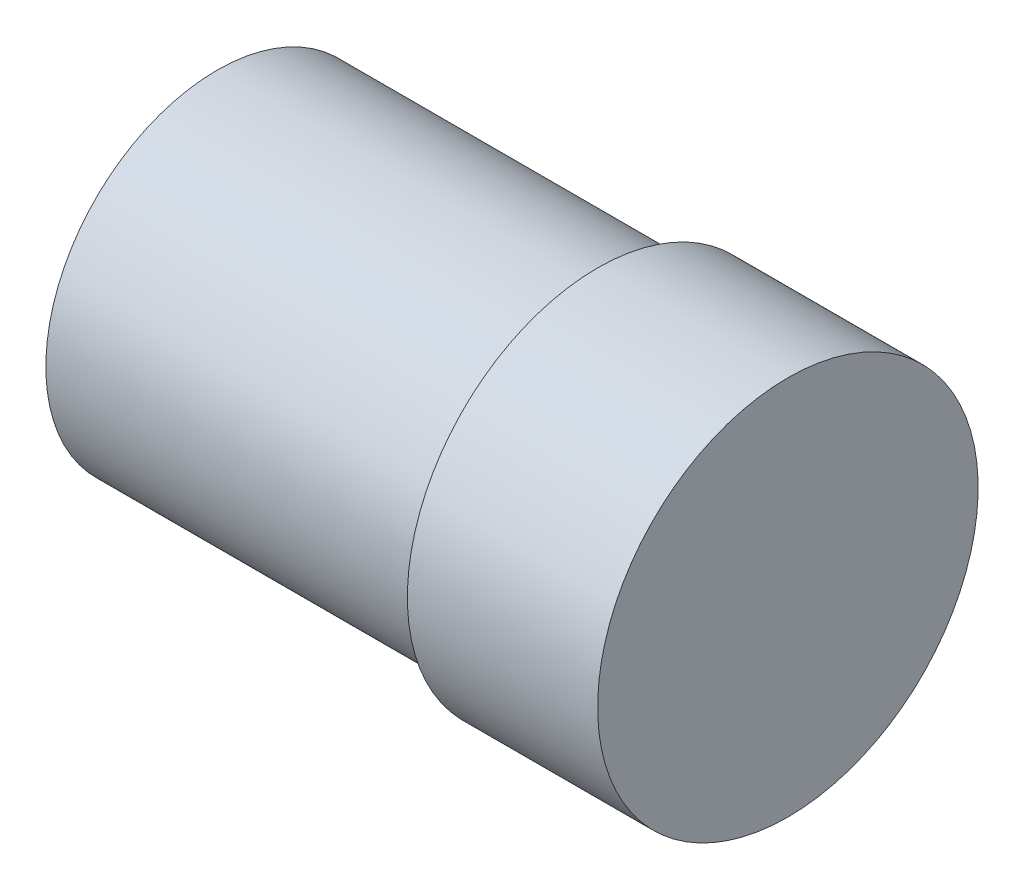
from build123d import *


with BuildPart() as part:
    # Skizze1 → Rotation1 (revolve)
    with BuildSketch(Plane.XY):
        Polygon((0, 0), (0, 4.5), (10, 4.5), (10, 5), (15, 5), (15, 0), align=None)
    revolve(axis=Axis((15, 0, 0), (-1, 0, 0)))


solid = part.part
